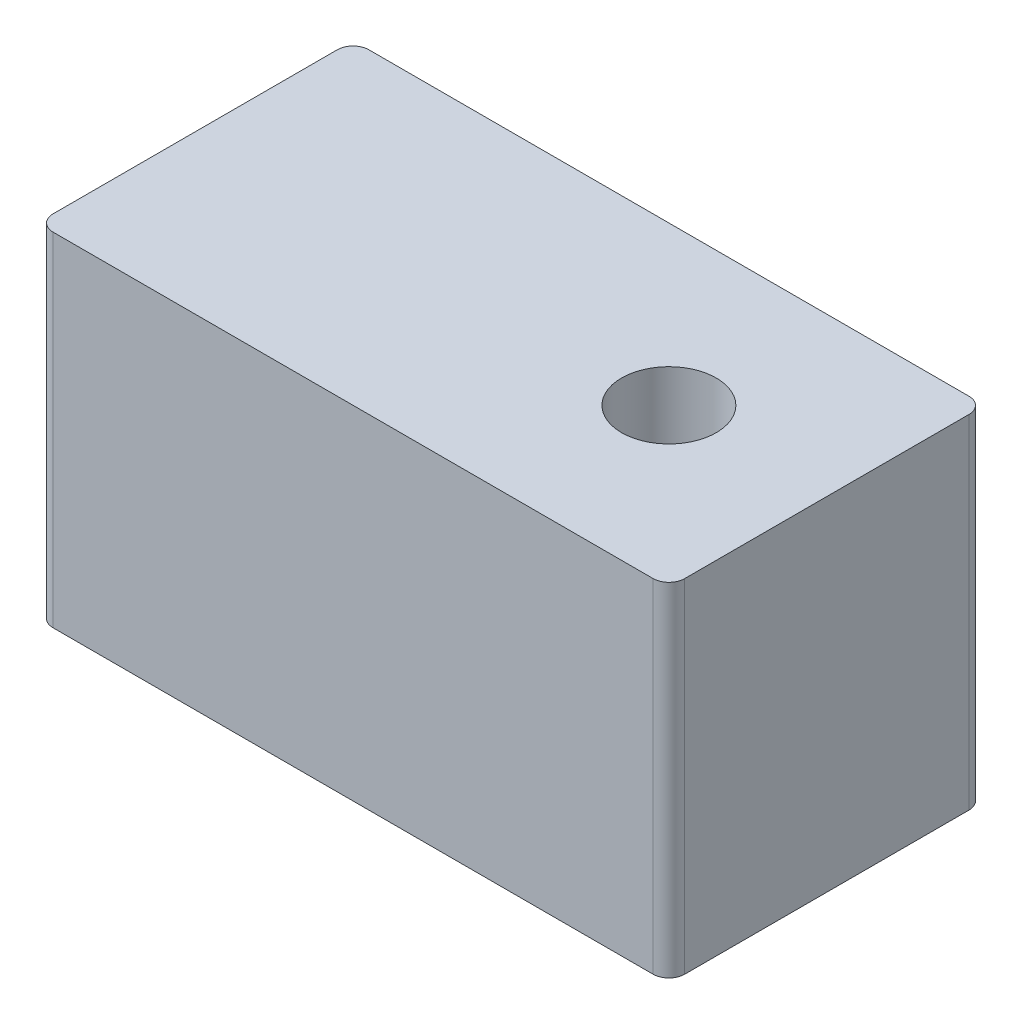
ISO-10303-21;
HEADER;
FILE_DESCRIPTION(('STEP AP214'),'2;1');
FILE_NAME('part.step','',(''),(''),'','','');
FILE_SCHEMA(('AUTOMOTIVE_DESIGN { 1 0 10303 214 1 1 1 1 }'));
ENDSEC;
DATA;
#1=APPLICATION_CONTEXT('core data for automotive mechanical design processes');
#2=APPLICATION_PROTOCOL_DEFINITION('international standard','automotive_design',2000,#1);
#3=PRODUCT_CONTEXT('',#1,'mechanical');
#4=PRODUCT('Part','Part','',(#3));
#5=PRODUCT_RELATED_PRODUCT_CATEGORY('part','',(#4));
#6=PRODUCT_DEFINITION_FORMATION('','',#4);
#7=PRODUCT_DEFINITION_CONTEXT('part definition',#1,'design');
#8=PRODUCT_DEFINITION('design','',#6,#7);
#9=PRODUCT_DEFINITION_SHAPE('','',#8);
#10=(LENGTH_UNIT() NAMED_UNIT(*) SI_UNIT(.MILLI.,.METRE.));
#11=(NAMED_UNIT(*) PLANE_ANGLE_UNIT() SI_UNIT($,.RADIAN.));
#12=(NAMED_UNIT(*) SI_UNIT($,.STERADIAN.) SOLID_ANGLE_UNIT());
#13=UNCERTAINTY_MEASURE_WITH_UNIT(LENGTH_MEASURE(1.E-05),#10,'distance_accuracy_value','');
#14=(GEOMETRIC_REPRESENTATION_CONTEXT(3) GLOBAL_UNCERTAINTY_ASSIGNED_CONTEXT((#13)) GLOBAL_UNIT_ASSIGNED_CONTEXT((#10,
#11,#12)) REPRESENTATION_CONTEXT('',''));
#15=CARTESIAN_POINT('',(0.,0.,0.));
#16=DIRECTION('',(0.,0.,1.));
#17=DIRECTION('',(1.,0.,0.));
#18=AXIS2_PLACEMENT_3D('',#15,#16,#17);
#19=CARTESIAN_POINT('',(19.,21.7,-8.99999999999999));
#20=DIRECTION('',(0.,-1.,0.));
#21=DIRECTION('',(0.,0.,-1.));
#22=AXIS2_PLACEMENT_3D('',#19,#20,#21);
#23=CYLINDRICAL_SURFACE('',#22,0.999999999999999);
#24=CARTESIAN_POINT('',(19.,0.,-8.99999999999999));
#25=DIRECTION('',(0.,1.,0.));
#26=DIRECTION('',(0.,0.,-1.));
#27=AXIS2_PLACEMENT_3D('',#24,#25,#26);
#28=CIRCLE('',#27,0.999999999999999);
#29=CARTESIAN_POINT('',(20.,0.,-9.));
#30=VERTEX_POINT('',#29);
#31=CARTESIAN_POINT('',(19.,0.,-9.99999999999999));
#32=VERTEX_POINT('',#31);
#33=EDGE_CURVE('E100',#30,#32,#28,.T.);
#34=ORIENTED_EDGE('',*,*,#33,.T.);
#35=DIRECTION('',(0.,-1.,0.));
#36=VECTOR('',#35,1.);
#37=CARTESIAN_POINT('',(19.,21.7,-9.99999999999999));
#38=LINE('',#37,#36);
#39=CARTESIAN_POINT('',(19.,21.7,-9.99999999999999));
#40=VERTEX_POINT('',#39);
#41=EDGE_CURVE('E11',#40,#32,#38,.T.);
#42=ORIENTED_EDGE('',*,*,#41,.F.);
#43=CARTESIAN_POINT('',(19.,21.7,-8.99999999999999));
#44=DIRECTION('',(0.,1.,0.));
#45=DIRECTION('',(0.,0.,-1.));
#46=AXIS2_PLACEMENT_3D('',#43,#44,#45);
#47=CIRCLE('',#46,0.999999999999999);
#48=CARTESIAN_POINT('',(20.,21.7,-9.));
#49=VERTEX_POINT('',#48);
#50=EDGE_CURVE('E132',#49,#40,#47,.T.);
#51=ORIENTED_EDGE('',*,*,#50,.F.);
#52=DIRECTION('',(0.,-1.,0.));
#53=VECTOR('',#52,1.);
#54=CARTESIAN_POINT('',(20.,21.7,-9.));
#55=LINE('',#54,#53);
#56=EDGE_CURVE('E113',#49,#30,#55,.T.);
#57=ORIENTED_EDGE('',*,*,#56,.T.);
#58=EDGE_LOOP('',(#34,#42,#51,#57));
#59=FACE_BOUND('',#58,.T.);
#60=ADVANCED_FACE('F32',(#59),#23,.T.);
#61=CARTESIAN_POINT('',(-19.,21.7,-9.99999999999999));
#62=DIRECTION('',(0.,0.,1.));
#63=DIRECTION('',(1.,0.,0.));
#64=AXIS2_PLACEMENT_3D('',#61,#62,#63);
#65=PLANE('',#64);
#66=DIRECTION('',(-1.,0.,0.));
#67=VECTOR('',#66,1.);
#68=CARTESIAN_POINT('',(-19.,0.,-9.99999999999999));
#69=LINE('',#68,#67);
#70=CARTESIAN_POINT('',(-19.,0.,-9.99999999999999));
#71=VERTEX_POINT('',#70);
#72=EDGE_CURVE('E96',#32,#71,#69,.T.);
#73=ORIENTED_EDGE('',*,*,#72,.T.);
#74=DIRECTION('',(0.,-1.,0.));
#75=VECTOR('',#74,1.);
#76=CARTESIAN_POINT('',(-19.,21.7,-9.99999999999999));
#77=LINE('',#76,#75);
#78=CARTESIAN_POINT('',(-19.,21.7,-9.99999999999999));
#79=VERTEX_POINT('',#78);
#80=EDGE_CURVE('E39',#79,#71,#77,.T.);
#81=ORIENTED_EDGE('',*,*,#80,.F.);
#82=DIRECTION('',(-1.,0.,0.));
#83=VECTOR('',#82,1.);
#84=CARTESIAN_POINT('',(-19.,21.7,-9.99999999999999));
#85=LINE('',#84,#83);
#86=EDGE_CURVE('E109',#40,#79,#85,.T.);
#87=ORIENTED_EDGE('',*,*,#86,.F.);
#88=ORIENTED_EDGE('',*,*,#41,.T.);
#89=EDGE_LOOP('',(#73,#81,#87,#88));
#90=FACE_BOUND('',#89,.T.);
#91=ADVANCED_FACE('F108',(#90),#65,.F.);
#92=CARTESIAN_POINT('',(-19.,21.7,-9.));
#93=DIRECTION('',(0.,-1.,0.));
#94=DIRECTION('',(0.,0.,-1.));
#95=AXIS2_PLACEMENT_3D('',#92,#93,#94);
#96=CYLINDRICAL_SURFACE('',#95,0.999999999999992);
#97=CARTESIAN_POINT('',(-19.,0.,-9.));
#98=DIRECTION('',(0.,1.,0.));
#99=DIRECTION('',(0.,0.,1.));
#100=AXIS2_PLACEMENT_3D('',#97,#98,#99);
#101=CIRCLE('',#100,0.999999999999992);
#102=CARTESIAN_POINT('',(-20.,0.,-9.00000000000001));
#103=VERTEX_POINT('',#102);
#104=EDGE_CURVE('E102',#71,#103,#101,.T.);
#105=ORIENTED_EDGE('',*,*,#104,.T.);
#106=DIRECTION('',(0.,-1.,0.));
#107=VECTOR('',#106,1.);
#108=CARTESIAN_POINT('',(-20.,21.7,-9.00000000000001));
#109=LINE('',#108,#107);
#110=CARTESIAN_POINT('',(-20.,21.7,-9.00000000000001));
#111=VERTEX_POINT('',#110);
#112=EDGE_CURVE('E158',#111,#103,#109,.T.);
#113=ORIENTED_EDGE('',*,*,#112,.F.);
#114=CARTESIAN_POINT('',(-19.,21.7,-9.));
#115=DIRECTION('',(0.,1.,0.));
#116=DIRECTION('',(0.,0.,1.));
#117=AXIS2_PLACEMENT_3D('',#114,#115,#116);
#118=CIRCLE('',#117,0.999999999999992);
#119=EDGE_CURVE('E135',#79,#111,#118,.T.);
#120=ORIENTED_EDGE('',*,*,#119,.F.);
#121=ORIENTED_EDGE('',*,*,#80,.T.);
#122=EDGE_LOOP('',(#105,#113,#120,#121));
#123=FACE_BOUND('',#122,.T.);
#124=ADVANCED_FACE('F162',(#123),#96,.T.);
#125=CARTESIAN_POINT('',(-20.,21.7,-9.00000000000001));
#126=DIRECTION('',(1.,0.,0.));
#127=DIRECTION('',(0.,0.,-1.));
#128=AXIS2_PLACEMENT_3D('',#125,#126,#127);
#129=PLANE('',#128);
#130=DIRECTION('',(0.,0.,1.));
#131=VECTOR('',#130,1.);
#132=CARTESIAN_POINT('',(-20.,0.,-9.00000000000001));
#133=LINE('',#132,#131);
#134=CARTESIAN_POINT('',(-20.,0.,9.00000000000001));
#135=VERTEX_POINT('',#134);
#136=EDGE_CURVE('E122',#103,#135,#133,.T.);
#137=ORIENTED_EDGE('',*,*,#136,.T.);
#138=DIRECTION('',(0.,-1.,0.));
#139=VECTOR('',#138,1.);
#140=CARTESIAN_POINT('',(-20.,21.7,9.00000000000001));
#141=LINE('',#140,#139);
#142=CARTESIAN_POINT('',(-20.,21.7,9.00000000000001));
#143=VERTEX_POINT('',#142);
#144=EDGE_CURVE('E155',#143,#135,#141,.T.);
#145=ORIENTED_EDGE('',*,*,#144,.F.);
#146=DIRECTION('',(0.,0.,1.));
#147=VECTOR('',#146,1.);
#148=CARTESIAN_POINT('',(-20.,21.7,-9.00000000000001));
#149=LINE('',#148,#147);
#150=EDGE_CURVE('E137',#111,#143,#149,.T.);
#151=ORIENTED_EDGE('',*,*,#150,.F.);
#152=ORIENTED_EDGE('',*,*,#112,.T.);
#153=EDGE_LOOP('',(#137,#145,#151,#152));
#154=FACE_BOUND('',#153,.T.);
#155=ADVANCED_FACE('F170',(#154),#129,.F.);
#156=CARTESIAN_POINT('',(-19.,21.7,9.));
#157=DIRECTION('',(0.,-1.,0.));
#158=DIRECTION('',(0.,0.,-1.));
#159=AXIS2_PLACEMENT_3D('',#156,#157,#158);
#160=CYLINDRICAL_SURFACE('',#159,0.999999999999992);
#161=CARTESIAN_POINT('',(-19.,0.,9.));
#162=DIRECTION('',(0.,1.,0.));
#163=DIRECTION('',(0.,0.,1.));
#164=AXIS2_PLACEMENT_3D('',#161,#162,#163);
#165=CIRCLE('',#164,0.999999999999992);
#166=CARTESIAN_POINT('',(-19.,0.,9.99999999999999));
#167=VERTEX_POINT('',#166);
#168=EDGE_CURVE('E124',#135,#167,#165,.T.);
#169=ORIENTED_EDGE('',*,*,#168,.T.);
#170=DIRECTION('',(0.,-1.,0.));
#171=VECTOR('',#170,1.);
#172=CARTESIAN_POINT('',(-19.,21.7,9.99999999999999));
#173=LINE('',#172,#171);
#174=CARTESIAN_POINT('',(-19.,21.7,9.99999999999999));
#175=VERTEX_POINT('',#174);
#176=EDGE_CURVE('E152',#175,#167,#173,.T.);
#177=ORIENTED_EDGE('',*,*,#176,.F.);
#178=CARTESIAN_POINT('',(-19.,21.7,9.));
#179=DIRECTION('',(0.,1.,0.));
#180=DIRECTION('',(0.,0.,1.));
#181=AXIS2_PLACEMENT_3D('',#178,#179,#180);
#182=CIRCLE('',#181,0.999999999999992);
#183=EDGE_CURVE('E139',#143,#175,#182,.T.);
#184=ORIENTED_EDGE('',*,*,#183,.F.);
#185=ORIENTED_EDGE('',*,*,#144,.T.);
#186=EDGE_LOOP('',(#169,#177,#184,#185));
#187=FACE_BOUND('',#186,.T.);
#188=ADVANCED_FACE('F173',(#187),#160,.T.);
#189=CARTESIAN_POINT('',(-19.,21.7,9.99999999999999));
#190=DIRECTION('',(0.,0.,-1.));
#191=DIRECTION('',(-1.,0.,0.));
#192=AXIS2_PLACEMENT_3D('',#189,#190,#191);
#193=PLANE('',#192);
#194=DIRECTION('',(1.,0.,0.));
#195=VECTOR('',#194,1.);
#196=CARTESIAN_POINT('',(-19.,0.,9.99999999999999));
#197=LINE('',#196,#195);
#198=CARTESIAN_POINT('',(19.,0.,9.99999999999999));
#199=VERTEX_POINT('',#198);
#200=EDGE_CURVE('E126',#167,#199,#197,.T.);
#201=ORIENTED_EDGE('',*,*,#200,.T.);
#202=DIRECTION('',(0.,-1.,0.));
#203=VECTOR('',#202,1.);
#204=CARTESIAN_POINT('',(19.,21.7,9.99999999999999));
#205=LINE('',#204,#203);
#206=CARTESIAN_POINT('',(19.,21.7,9.99999999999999));
#207=VERTEX_POINT('',#206);
#208=EDGE_CURVE('E149',#207,#199,#205,.T.);
#209=ORIENTED_EDGE('',*,*,#208,.F.);
#210=DIRECTION('',(1.,0.,0.));
#211=VECTOR('',#210,1.);
#212=CARTESIAN_POINT('',(-19.,21.7,9.99999999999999));
#213=LINE('',#212,#211);
#214=EDGE_CURVE('E141',#175,#207,#213,.T.);
#215=ORIENTED_EDGE('',*,*,#214,.F.);
#216=ORIENTED_EDGE('',*,*,#176,.T.);
#217=EDGE_LOOP('',(#201,#209,#215,#216));
#218=FACE_BOUND('',#217,.T.);
#219=ADVANCED_FACE('F178',(#218),#193,.F.);
#220=CARTESIAN_POINT('',(19.,21.7,8.99999999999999));
#221=DIRECTION('',(0.,-1.,0.));
#222=DIRECTION('',(0.,0.,-1.));
#223=AXIS2_PLACEMENT_3D('',#220,#221,#222);
#224=CYLINDRICAL_SURFACE('',#223,0.999999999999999);
#225=CARTESIAN_POINT('',(19.,0.,8.99999999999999));
#226=DIRECTION('',(0.,1.,0.));
#227=DIRECTION('',(0.,0.,-1.));
#228=AXIS2_PLACEMENT_3D('',#225,#226,#227);
#229=CIRCLE('',#228,0.999999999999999);
#230=CARTESIAN_POINT('',(20.,0.,9.));
#231=VERTEX_POINT('',#230);
#232=EDGE_CURVE('E128',#199,#231,#229,.T.);
#233=ORIENTED_EDGE('',*,*,#232,.T.);
#234=DIRECTION('',(0.,-1.,0.));
#235=VECTOR('',#234,1.);
#236=CARTESIAN_POINT('',(20.,21.7,9.));
#237=LINE('',#236,#235);
#238=CARTESIAN_POINT('',(20.,21.7,9.));
#239=VERTEX_POINT('',#238);
#240=EDGE_CURVE('E146',#239,#231,#237,.T.);
#241=ORIENTED_EDGE('',*,*,#240,.F.);
#242=CARTESIAN_POINT('',(19.,21.7,8.99999999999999));
#243=DIRECTION('',(0.,1.,0.));
#244=DIRECTION('',(0.,0.,-1.));
#245=AXIS2_PLACEMENT_3D('',#242,#243,#244);
#246=CIRCLE('',#245,0.999999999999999);
#247=EDGE_CURVE('E51',#207,#239,#246,.T.);
#248=ORIENTED_EDGE('',*,*,#247,.F.);
#249=ORIENTED_EDGE('',*,*,#208,.T.);
#250=EDGE_LOOP('',(#233,#241,#248,#249));
#251=FACE_BOUND('',#250,.T.);
#252=ADVANCED_FACE('F181',(#251),#224,.T.);
#253=CARTESIAN_POINT('',(20.,21.7,-9.));
#254=DIRECTION('',(-1.,0.,0.));
#255=DIRECTION('',(0.,0.,1.));
#256=AXIS2_PLACEMENT_3D('',#253,#254,#255);
#257=PLANE('',#256);
#258=DIRECTION('',(0.,0.,-1.));
#259=VECTOR('',#258,1.);
#260=CARTESIAN_POINT('',(20.,0.,-9.));
#261=LINE('',#260,#259);
#262=EDGE_CURVE('E130',#231,#30,#261,.T.);
#263=ORIENTED_EDGE('',*,*,#262,.T.);
#264=ORIENTED_EDGE('',*,*,#56,.F.);
#265=DIRECTION('',(0.,0.,-1.));
#266=VECTOR('',#265,1.);
#267=CARTESIAN_POINT('',(20.,21.7,-9.));
#268=LINE('',#267,#266);
#269=EDGE_CURVE('E46',#239,#49,#268,.T.);
#270=ORIENTED_EDGE('',*,*,#269,.F.);
#271=ORIENTED_EDGE('',*,*,#240,.T.);
#272=EDGE_LOOP('',(#263,#264,#270,#271));
#273=FACE_BOUND('',#272,.T.);
#274=ADVANCED_FACE('F183',(#273),#257,.F.);
#275=CARTESIAN_POINT('',(19.,21.7,-8.99999999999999));
#276=DIRECTION('',(0.,-1.,0.));
#277=DIRECTION('',(0.,0.,-1.));
#278=AXIS2_PLACEMENT_3D('',#275,#276,#277);
#279=PLANE('',#278);
#280=CARTESIAN_POINT('',(10.,21.7,0.));
#281=DIRECTION('',(0.,1.,0.));
#282=DIRECTION('',(0.,0.,1.));
#283=AXIS2_PLACEMENT_3D('',#280,#281,#282);
#284=CIRCLE('',#283,3.);
#285=CARTESIAN_POINT('',(10.,21.7,3.));
#286=VERTEX_POINT('',#285);
#287=EDGE_CURVE('E117',#286,#286,#284,.T.);
#288=ORIENTED_EDGE('',*,*,#287,.F.);
#289=EDGE_LOOP('',(#288));
#290=FACE_BOUND('',#289,.T.);
#291=ORIENTED_EDGE('',*,*,#50,.T.);
#292=ORIENTED_EDGE('',*,*,#86,.T.);
#293=ORIENTED_EDGE('',*,*,#119,.T.);
#294=ORIENTED_EDGE('',*,*,#150,.T.);
#295=ORIENTED_EDGE('',*,*,#183,.T.);
#296=ORIENTED_EDGE('',*,*,#214,.T.);
#297=ORIENTED_EDGE('',*,*,#247,.T.);
#298=ORIENTED_EDGE('',*,*,#269,.T.);
#299=EDGE_LOOP('',(#291,#292,#293,#294,#295,#296,#297,#298));
#300=FACE_BOUND('',#299,.T.);
#301=ADVANCED_FACE('F165',(#290,#300),#279,.F.);
#302=CARTESIAN_POINT('',(19.,0.,-8.99999999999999));
#303=DIRECTION('',(0.,-1.,0.));
#304=DIRECTION('',(0.,0.,-1.));
#305=AXIS2_PLACEMENT_3D('',#302,#303,#304);
#306=PLANE('',#305);
#307=ORIENTED_EDGE('',*,*,#33,.F.);
#308=ORIENTED_EDGE('',*,*,#262,.F.);
#309=ORIENTED_EDGE('',*,*,#232,.F.);
#310=ORIENTED_EDGE('',*,*,#200,.F.);
#311=ORIENTED_EDGE('',*,*,#168,.F.);
#312=ORIENTED_EDGE('',*,*,#136,.F.);
#313=ORIENTED_EDGE('',*,*,#104,.F.);
#314=ORIENTED_EDGE('',*,*,#72,.F.);
#315=EDGE_LOOP('',(#307,#308,#309,#310,#311,#312,#313,#314));
#316=FACE_BOUND('',#315,.T.);
#317=ADVANCED_FACE('F97',(#316),#306,.T.);
#318=CARTESIAN_POINT('',(10.,11.7,0.));
#319=DIRECTION('',(0.,1.,0.));
#320=DIRECTION('',(0.,0.,1.));
#321=AXIS2_PLACEMENT_3D('',#318,#319,#320);
#322=CYLINDRICAL_SURFACE('',#321,3.);
#323=CARTESIAN_POINT('',(10.,11.7,0.));
#324=DIRECTION('',(0.,1.,0.));
#325=DIRECTION('',(0.,0.,1.));
#326=AXIS2_PLACEMENT_3D('',#323,#324,#325);
#327=CIRCLE('',#326,3.);
#328=CARTESIAN_POINT('',(10.,11.7,3.));
#329=VERTEX_POINT('',#328);
#330=EDGE_CURVE('E114',#329,#329,#327,.T.);
#331=ORIENTED_EDGE('',*,*,#330,.F.);
#332=EDGE_LOOP('',(#331));
#333=FACE_BOUND('',#332,.T.);
#334=ORIENTED_EDGE('',*,*,#287,.T.);
#335=EDGE_LOOP('',(#334));
#336=FACE_BOUND('',#335,.T.);
#337=ADVANCED_FACE('F229',(#333,#336),#322,.F.);
#338=CARTESIAN_POINT('',(10.,11.7,0.));
#339=DIRECTION('',(0.,1.,0.));
#340=DIRECTION('',(0.,0.,1.));
#341=AXIS2_PLACEMENT_3D('',#338,#339,#340);
#342=PLANE('',#341);
#343=ORIENTED_EDGE('',*,*,#330,.T.);
#344=EDGE_LOOP('',(#343));
#345=FACE_BOUND('',#344,.T.);
#346=ADVANCED_FACE('F243',(#345),#342,.T.);
#347=CLOSED_SHELL('',(#60,#91,#124,#155,#188,#219,#252,#274,#301,#317,#337,#346));
#348=MANIFOLD_SOLID_BREP('B2',#347);
#349=ADVANCED_BREP_SHAPE_REPRESENTATION('',(#18,#348),#14);
#350=SHAPE_DEFINITION_REPRESENTATION(#9,#349);
ENDSEC;
END-ISO-10303-21;
